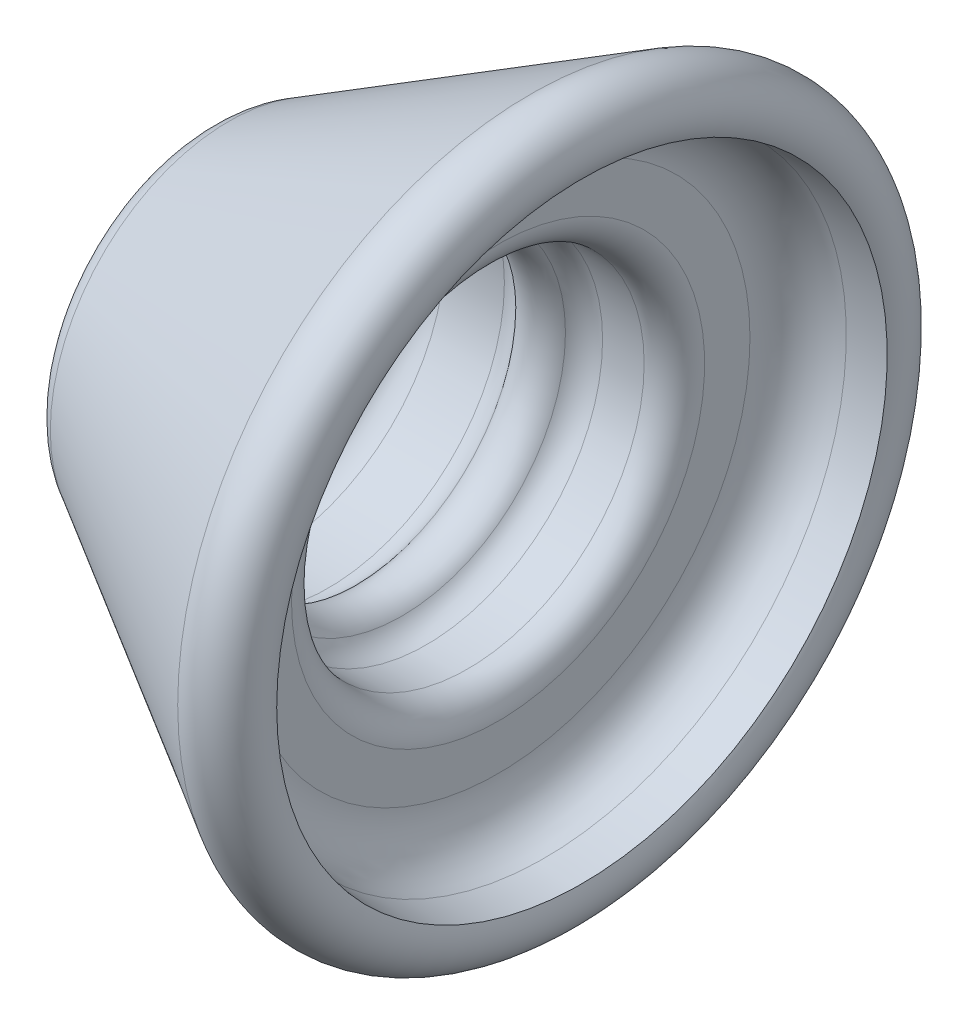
ISO-10303-21;
HEADER;
FILE_DESCRIPTION(('STEP AP214'),'2;1');
FILE_NAME('part.step','',(''),(''),'','','');
FILE_SCHEMA(('AUTOMOTIVE_DESIGN { 1 0 10303 214 1 1 1 1 }'));
ENDSEC;
DATA;
#1=APPLICATION_CONTEXT('core data for automotive mechanical design processes');
#2=APPLICATION_PROTOCOL_DEFINITION('international standard','automotive_design',2000,#1);
#3=PRODUCT_CONTEXT('',#1,'mechanical');
#4=PRODUCT('Part','Part','',(#3));
#5=PRODUCT_RELATED_PRODUCT_CATEGORY('part','',(#4));
#6=PRODUCT_DEFINITION_FORMATION('','',#4);
#7=PRODUCT_DEFINITION_CONTEXT('part definition',#1,'design');
#8=PRODUCT_DEFINITION('design','',#6,#7);
#9=PRODUCT_DEFINITION_SHAPE('','',#8);
#10=(LENGTH_UNIT() NAMED_UNIT(*) SI_UNIT(.MILLI.,.METRE.));
#11=(NAMED_UNIT(*) PLANE_ANGLE_UNIT() SI_UNIT($,.RADIAN.));
#12=(NAMED_UNIT(*) SI_UNIT($,.STERADIAN.) SOLID_ANGLE_UNIT());
#13=UNCERTAINTY_MEASURE_WITH_UNIT(LENGTH_MEASURE(1.E-05),#10,'distance_accuracy_value','');
#14=(GEOMETRIC_REPRESENTATION_CONTEXT(3) GLOBAL_UNCERTAINTY_ASSIGNED_CONTEXT((#13)) GLOBAL_UNIT_ASSIGNED_CONTEXT((#10,
#11,#12)) REPRESENTATION_CONTEXT('',''));
#15=CARTESIAN_POINT('',(0.,0.,0.));
#16=DIRECTION('',(0.,0.,1.));
#17=DIRECTION('',(1.,0.,0.));
#18=AXIS2_PLACEMENT_3D('',#15,#16,#17);
#19=CARTESIAN_POINT('',(13.0051479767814,0.,0.));
#20=DIRECTION('',(-1.,0.,0.));
#21=DIRECTION('',(0.,0.,1.));
#22=AXIS2_PLACEMENT_3D('',#19,#20,#21);
#23=TOROIDAL_SURFACE('',#22,25.,4.99862383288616);
#24=CARTESIAN_POINT('',(12.587211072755,0.,0.));
#25=DIRECTION('',(-1.,0.,0.));
#26=DIRECTION('',(0.,0.,1.));
#27=AXIS2_PLACEMENT_3D('',#24,#25,#26);
#28=CIRCLE('',#27,29.9811212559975);
#29=CARTESIAN_POINT('',(12.587211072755,-1.34807211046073E-13,29.9811212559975));
#30=VERTEX_POINT('',#29);
#31=EDGE_CURVE('E12',#30,#30,#28,.T.);
#32=ORIENTED_EDGE('',*,*,#31,.F.);
#33=EDGE_LOOP('',(#32));
#34=FACE_BOUND('',#33,.T.);
#35=CARTESIAN_POINT('',(8.00652414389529,0.,0.));
#36=DIRECTION('',(-1.,0.,0.));
#37=DIRECTION('',(0.,0.,1.));
#38=AXIS2_PLACEMENT_3D('',#35,#36,#37);
#39=CIRCLE('',#38,25.);
#40=CARTESIAN_POINT('',(8.00652414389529,-1.12410081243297E-13,25.));
#41=VERTEX_POINT('',#40);
#42=EDGE_CURVE('E408',#41,#41,#39,.T.);
#43=ORIENTED_EDGE('',*,*,#42,.T.);
#44=EDGE_LOOP('',(#43));
#45=FACE_BOUND('',#44,.T.);
#46=ADVANCED_FACE('F356',(#34,#45),#23,.F.);
#47=CARTESIAN_POINT('',(12.587211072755,0.,0.));
#48=DIRECTION('',(1.,0.,0.));
#49=DIRECTION('',(0.,0.,-1.));
#50=AXIS2_PLACEMENT_3D('',#47,#48,#49);
#51=CONICAL_SURFACE('',#50,29.9811212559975,0.0837081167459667);
#52=CARTESIAN_POINT('',(16.3310799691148,0.,0.));
#53=DIRECTION('',(-1.,0.,0.));
#54=DIRECTION('',(0.,0.,1.));
#55=AXIS2_PLACEMENT_3D('',#52,#53,#54);
#56=CIRCLE('',#55,30.2952475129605);
#57=CARTESIAN_POINT('',(16.3310799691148,-1.36219649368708E-13,30.2952475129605));
#58=VERTEX_POINT('',#57);
#59=EDGE_CURVE('E362',#58,#58,#56,.T.);
#60=ORIENTED_EDGE('',*,*,#59,.F.);
#61=EDGE_LOOP('',(#60));
#62=FACE_BOUND('',#61,.T.);
#63=ORIENTED_EDGE('',*,*,#31,.T.);
#64=EDGE_LOOP('',(#63));
#65=FACE_BOUND('',#64,.T.);
#66=ADVANCED_FACE('F493',(#62,#65),#51,.F.);
#67=CARTESIAN_POINT('',(13.0262357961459,0.,0.));
#68=DIRECTION('',(-1.,0.,0.));
#69=DIRECTION('',(0.,0.,1.));
#70=AXIS2_PLACEMENT_3D('',#67,#68,#69);
#71=TOROIDAL_SURFACE('',#70,31.8356453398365,3.6462063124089);
#72=CARTESIAN_POINT('',(11.2031326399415,0.,0.));
#73=DIRECTION('',(-1.,0.,0.));
#74=DIRECTION('',(0.,0.,1.));
#75=AXIS2_PLACEMENT_3D('',#72,#73,#74);
#76=CIRCLE('',#75,34.9933526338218);
#77=CARTESIAN_POINT('',(11.2031326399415,-1.5734422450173E-13,34.9933526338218));
#78=VERTEX_POINT('',#77);
#79=EDGE_CURVE('E366',#78,#78,#76,.T.);
#80=ORIENTED_EDGE('',*,*,#79,.F.);
#81=EDGE_LOOP('',(#80));
#82=FACE_BOUND('',#81,.T.);
#83=ORIENTED_EDGE('',*,*,#59,.T.);
#84=EDGE_LOOP('',(#83));
#85=FACE_BOUND('',#84,.T.);
#86=ADVANCED_FACE('F488',(#82,#85),#71,.T.);
#87=CARTESIAN_POINT('',(11.2031326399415,0.,0.));
#88=DIRECTION('',(1.,0.,0.));
#89=DIRECTION('',(0.,0.,-1.));
#90=AXIS2_PLACEMENT_3D('',#87,#88,#89);
#91=CONICAL_SURFACE('',#90,34.9933526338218,0.523598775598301);
#92=CARTESIAN_POINT('',(-18.7062116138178,0.,0.));
#93=DIRECTION('',(-1.,0.,0.));
#94=DIRECTION('',(0.,0.,1.));
#95=AXIS2_PLACEMENT_3D('',#92,#93,#94);
#96=CIRCLE('',#95,17.7251846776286);
#97=CARTESIAN_POINT('',(-18.7062116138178,0.,17.7251846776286));
#98=VERTEX_POINT('',#97);
#99=EDGE_CURVE('E370',#98,#98,#96,.T.);
#100=ORIENTED_EDGE('',*,*,#99,.F.);
#101=EDGE_LOOP('',(#100));
#102=FACE_BOUND('',#101,.T.);
#103=ORIENTED_EDGE('',*,*,#79,.T.);
#104=EDGE_LOOP('',(#103));
#105=FACE_BOUND('',#104,.T.);
#106=ADVANCED_FACE('F482',(#102,#105),#91,.T.);
#107=CARTESIAN_POINT('',(-16.4403817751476,0.,0.));
#108=DIRECTION('',(-1.,0.,0.));
#109=DIRECTION('',(0.,0.,1.));
#110=AXIS2_PLACEMENT_3D('',#107,#108,#109);
#111=TOROIDAL_SURFACE('',#110,13.2680538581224,5.);
#112=CARTESIAN_POINT('',(-21.4403817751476,0.,0.));
#113=DIRECTION('',(-1.,0.,0.));
#114=DIRECTION('',(0.,0.,1.));
#115=AXIS2_PLACEMENT_3D('',#112,#113,#114);
#116=CIRCLE('',#115,13.2680538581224);
#117=CARTESIAN_POINT('',(-21.4403817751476,0.,13.2680538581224));
#118=VERTEX_POINT('',#117);
#119=EDGE_CURVE('E375',#118,#118,#116,.T.);
#120=ORIENTED_EDGE('',*,*,#119,.F.);
#121=EDGE_LOOP('',(#120));
#122=FACE_BOUND('',#121,.T.);
#123=ORIENTED_EDGE('',*,*,#99,.T.);
#124=EDGE_LOOP('',(#123));
#125=FACE_BOUND('',#124,.T.);
#126=ADVANCED_FACE('F476',(#122,#125),#111,.T.);
#127=CARTESIAN_POINT('',(-21.4403817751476,10.5,0.));
#128=DIRECTION('',(1.,0.,0.));
#129=DIRECTION('',(0.,0.,-1.));
#130=AXIS2_PLACEMENT_3D('',#127,#128,#129);
#131=PLANE('',#130);
#132=CARTESIAN_POINT('',(-21.4403817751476,0.,0.));
#133=DIRECTION('',(-1.,0.,0.));
#134=DIRECTION('',(0.,0.,1.));
#135=AXIS2_PLACEMENT_3D('',#132,#133,#134);
#136=CIRCLE('',#135,10.5);
#137=CARTESIAN_POINT('',(-21.4403817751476,0.,10.5));
#138=VERTEX_POINT('',#137);
#139=EDGE_CURVE('E378',#138,#138,#136,.T.);
#140=ORIENTED_EDGE('',*,*,#139,.F.);
#141=EDGE_LOOP('',(#140));
#142=FACE_BOUND('',#141,.T.);
#143=ORIENTED_EDGE('',*,*,#119,.T.);
#144=EDGE_LOOP('',(#143));
#145=FACE_BOUND('',#144,.T.);
#146=ADVANCED_FACE('F470',(#142,#145),#131,.F.);
#147=CARTESIAN_POINT('',(-50.,0.,0.));
#148=DIRECTION('',(-1.,0.,0.));
#149=DIRECTION('',(0.,0.,1.));
#150=AXIS2_PLACEMENT_3D('',#147,#148,#149);
#151=CYLINDRICAL_SURFACE('',#150,10.5);
#152=CARTESIAN_POINT('',(-17.7370474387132,0.,0.));
#153=DIRECTION('',(-1.,0.,0.));
#154=DIRECTION('',(0.,0.,1.));
#155=AXIS2_PLACEMENT_3D('',#152,#153,#154);
#156=CIRCLE('',#155,10.5);
#157=CARTESIAN_POINT('',(-17.7370474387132,0.,10.5));
#158=VERTEX_POINT('',#157);
#159=EDGE_CURVE('E381',#158,#158,#156,.T.);
#160=ORIENTED_EDGE('',*,*,#159,.F.);
#161=EDGE_LOOP('',(#160));
#162=FACE_BOUND('',#161,.T.);
#163=ORIENTED_EDGE('',*,*,#139,.T.);
#164=EDGE_LOOP('',(#163));
#165=FACE_BOUND('',#164,.T.);
#166=ADVANCED_FACE('F464',(#162,#165),#151,.F.);
#167=CARTESIAN_POINT('',(-17.7370474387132,14.4999999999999,0.));
#168=DIRECTION('',(-1.,0.,0.));
#169=DIRECTION('',(0.,0.,1.));
#170=AXIS2_PLACEMENT_3D('',#167,#168,#169);
#171=PLANE('',#170);
#172=CARTESIAN_POINT('',(-17.7370474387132,0.,0.));
#173=DIRECTION('',(-1.,0.,0.));
#174=DIRECTION('',(0.,0.,1.));
#175=AXIS2_PLACEMENT_3D('',#172,#173,#174);
#176=CIRCLE('',#175,14.4999999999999);
#177=CARTESIAN_POINT('',(-17.7370474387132,0.,14.4999999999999));
#178=VERTEX_POINT('',#177);
#179=EDGE_CURVE('E384',#178,#178,#176,.T.);
#180=ORIENTED_EDGE('',*,*,#179,.F.);
#181=EDGE_LOOP('',(#180));
#182=FACE_BOUND('',#181,.T.);
#183=ORIENTED_EDGE('',*,*,#159,.T.);
#184=EDGE_LOOP('',(#183));
#185=FACE_BOUND('',#184,.T.);
#186=ADVANCED_FACE('F458',(#182,#185),#171,.F.);
#187=CARTESIAN_POINT('',(-14.7370474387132,0.,0.));
#188=DIRECTION('',(-1.,0.,0.));
#189=DIRECTION('',(0.,0.,1.));
#190=AXIS2_PLACEMENT_3D('',#187,#188,#189);
#191=TOROIDAL_SURFACE('',#190,14.4999999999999,2.99999999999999);
#192=CARTESIAN_POINT('',(-14.7370474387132,0.,0.));
#193=DIRECTION('',(-1.,0.,0.));
#194=DIRECTION('',(0.,0.,1.));
#195=AXIS2_PLACEMENT_3D('',#192,#193,#194);
#196=CIRCLE('',#195,17.4999999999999);
#197=CARTESIAN_POINT('',(-14.7370474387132,0.,17.4999999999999));
#198=VERTEX_POINT('',#197);
#199=EDGE_CURVE('E387',#198,#198,#196,.T.);
#200=ORIENTED_EDGE('',*,*,#199,.F.);
#201=EDGE_LOOP('',(#200));
#202=FACE_BOUND('',#201,.T.);
#203=ORIENTED_EDGE('',*,*,#179,.T.);
#204=EDGE_LOOP('',(#203));
#205=FACE_BOUND('',#204,.T.);
#206=ADVANCED_FACE('F452',(#202,#205),#191,.F.);
#207=CARTESIAN_POINT('',(-50.,0.,0.));
#208=DIRECTION('',(-1.,0.,0.));
#209=DIRECTION('',(0.,0.,1.));
#210=AXIS2_PLACEMENT_3D('',#207,#208,#209);
#211=CYLINDRICAL_SURFACE('',#210,17.4999999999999);
#212=CARTESIAN_POINT('',(-8.8666656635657,0.,0.));
#213=DIRECTION('',(-1.,0.,0.));
#214=DIRECTION('',(0.,0.,1.));
#215=AXIS2_PLACEMENT_3D('',#212,#213,#214);
#216=CIRCLE('',#215,17.4999999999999);
#217=CARTESIAN_POINT('',(-8.8666656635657,0.,17.4999999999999));
#218=VERTEX_POINT('',#217);
#219=EDGE_CURVE('E390',#218,#218,#216,.T.);
#220=ORIENTED_EDGE('',*,*,#219,.F.);
#221=EDGE_LOOP('',(#220));
#222=FACE_BOUND('',#221,.T.);
#223=ORIENTED_EDGE('',*,*,#199,.T.);
#224=EDGE_LOOP('',(#223));
#225=FACE_BOUND('',#224,.T.);
#226=ADVANCED_FACE('F446',(#222,#225),#211,.F.);
#227=CARTESIAN_POINT('',(-8.8666656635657,0.,0.));
#228=DIRECTION('',(-1.,0.,0.));
#229=DIRECTION('',(0.,0.,1.));
#230=AXIS2_PLACEMENT_3D('',#227,#228,#229);
#231=TOROIDAL_SURFACE('',#230,14.4999999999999,2.99999999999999);
#232=CARTESIAN_POINT('',(-6.42996707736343,0.,0.));
#233=DIRECTION('',(-1.,0.,0.));
#234=DIRECTION('',(0.,0.,1.));
#235=AXIS2_PLACEMENT_3D('',#232,#233,#234);
#236=CIRCLE('',#235,16.2499999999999);
#237=CARTESIAN_POINT('',(-6.42996707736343,0.,16.2499999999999));
#238=VERTEX_POINT('',#237);
#239=EDGE_CURVE('E393',#238,#238,#236,.T.);
#240=ORIENTED_EDGE('',*,*,#239,.F.);
#241=EDGE_LOOP('',(#240));
#242=FACE_BOUND('',#241,.T.);
#243=ORIENTED_EDGE('',*,*,#219,.T.);
#244=EDGE_LOOP('',(#243));
#245=FACE_BOUND('',#244,.T.);
#246=ADVANCED_FACE('F440',(#242,#245),#231,.F.);
#247=CARTESIAN_POINT('',(-3.99326849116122,0.,0.));
#248=DIRECTION('',(-1.,0.,0.));
#249=DIRECTION('',(0.,0.,1.));
#250=AXIS2_PLACEMENT_3D('',#247,#248,#249);
#251=TOROIDAL_SURFACE('',#250,17.9999999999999,3.);
#252=CARTESIAN_POINT('',(-1.55656990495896,0.,0.));
#253=DIRECTION('',(-1.,0.,0.));
#254=DIRECTION('',(0.,0.,1.));
#255=AXIS2_PLACEMENT_3D('',#252,#253,#254);
#256=CIRCLE('',#255,16.2499999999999);
#257=CARTESIAN_POINT('',(-1.55656990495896,0.,16.2499999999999));
#258=VERTEX_POINT('',#257);
#259=EDGE_CURVE('E396',#258,#258,#256,.T.);
#260=ORIENTED_EDGE('',*,*,#259,.F.);
#261=EDGE_LOOP('',(#260));
#262=FACE_BOUND('',#261,.T.);
#263=ORIENTED_EDGE('',*,*,#239,.T.);
#264=EDGE_LOOP('',(#263));
#265=FACE_BOUND('',#264,.T.);
#266=ADVANCED_FACE('F434',(#262,#265),#251,.T.);
#267=CARTESIAN_POINT('',(0.880128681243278,0.,0.));
#268=DIRECTION('',(-1.,0.,0.));
#269=DIRECTION('',(0.,0.,1.));
#270=AXIS2_PLACEMENT_3D('',#267,#268,#269);
#271=TOROIDAL_SURFACE('',#270,14.4999999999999,2.99999999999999);
#272=CARTESIAN_POINT('',(0.880128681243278,0.,0.));
#273=DIRECTION('',(-1.,0.,0.));
#274=DIRECTION('',(0.,0.,1.));
#275=AXIS2_PLACEMENT_3D('',#272,#273,#274);
#276=CIRCLE('',#275,17.4999999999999);
#277=CARTESIAN_POINT('',(0.880128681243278,0.,17.4999999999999));
#278=VERTEX_POINT('',#277);
#279=EDGE_CURVE('E399',#278,#278,#276,.T.);
#280=ORIENTED_EDGE('',*,*,#279,.F.);
#281=EDGE_LOOP('',(#280));
#282=FACE_BOUND('',#281,.T.);
#283=ORIENTED_EDGE('',*,*,#259,.T.);
#284=EDGE_LOOP('',(#283));
#285=FACE_BOUND('',#284,.T.);
#286=ADVANCED_FACE('F428',(#282,#285),#271,.F.);
#287=CARTESIAN_POINT('',(-50.,0.,0.));
#288=DIRECTION('',(-1.,0.,0.));
#289=DIRECTION('',(0.,0.,1.));
#290=AXIS2_PLACEMENT_3D('',#287,#288,#289);
#291=CYLINDRICAL_SURFACE('',#290,17.4999999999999);
#292=CARTESIAN_POINT('',(5.0065241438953,0.,0.));
#293=DIRECTION('',(-1.,0.,0.));
#294=DIRECTION('',(0.,0.,1.));
#295=AXIS2_PLACEMENT_3D('',#292,#293,#294);
#296=CIRCLE('',#295,17.4999999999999);
#297=CARTESIAN_POINT('',(5.0065241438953,0.,17.4999999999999));
#298=VERTEX_POINT('',#297);
#299=EDGE_CURVE('E402',#298,#298,#296,.T.);
#300=ORIENTED_EDGE('',*,*,#299,.F.);
#301=EDGE_LOOP('',(#300));
#302=FACE_BOUND('',#301,.T.);
#303=ORIENTED_EDGE('',*,*,#279,.T.);
#304=EDGE_LOOP('',(#303));
#305=FACE_BOUND('',#304,.T.);
#306=ADVANCED_FACE('F422',(#302,#305),#291,.F.);
#307=CARTESIAN_POINT('',(5.0065241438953,0.,0.));
#308=DIRECTION('',(-1.,0.,0.));
#309=DIRECTION('',(0.,0.,1.));
#310=AXIS2_PLACEMENT_3D('',#307,#308,#309);
#311=TOROIDAL_SURFACE('',#310,20.4999999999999,2.99999999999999);
#312=CARTESIAN_POINT('',(8.00652414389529,0.,0.));
#313=DIRECTION('',(-1.,0.,0.));
#314=DIRECTION('',(0.,0.,1.));
#315=AXIS2_PLACEMENT_3D('',#312,#313,#314);
#316=CIRCLE('',#315,20.4999999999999);
#317=CARTESIAN_POINT('',(8.00652414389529,0.,20.4999999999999));
#318=VERTEX_POINT('',#317);
#319=EDGE_CURVE('E405',#318,#318,#316,.T.);
#320=ORIENTED_EDGE('',*,*,#319,.F.);
#321=EDGE_LOOP('',(#320));
#322=FACE_BOUND('',#321,.T.);
#323=ORIENTED_EDGE('',*,*,#299,.T.);
#324=EDGE_LOOP('',(#323));
#325=FACE_BOUND('',#324,.T.);
#326=ADVANCED_FACE('F416',(#322,#325),#311,.T.);
#327=CARTESIAN_POINT('',(8.00652414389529,25.,-1.12410081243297E-13));
#328=DIRECTION('',(-1.,0.,0.));
#329=DIRECTION('',(0.,0.,1.));
#330=AXIS2_PLACEMENT_3D('',#327,#328,#329);
#331=PLANE('',#330);
#332=ORIENTED_EDGE('',*,*,#42,.F.);
#333=EDGE_LOOP('',(#332));
#334=FACE_BOUND('',#333,.T.);
#335=ORIENTED_EDGE('',*,*,#319,.T.);
#336=EDGE_LOOP('',(#335));
#337=FACE_BOUND('',#336,.T.);
#338=ADVANCED_FACE('F413',(#334,#337),#331,.F.);
#339=CLOSED_SHELL('',(#46,#66,#86,#106,#126,#146,#166,#186,#206,#226,#246,#266,#286,#306,#326,#338));
#340=MANIFOLD_SOLID_BREP('B2',#339);
#341=ADVANCED_BREP_SHAPE_REPRESENTATION('',(#18,#340),#14);
#342=SHAPE_DEFINITION_REPRESENTATION(#9,#341);
ENDSEC;
END-ISO-10303-21;
